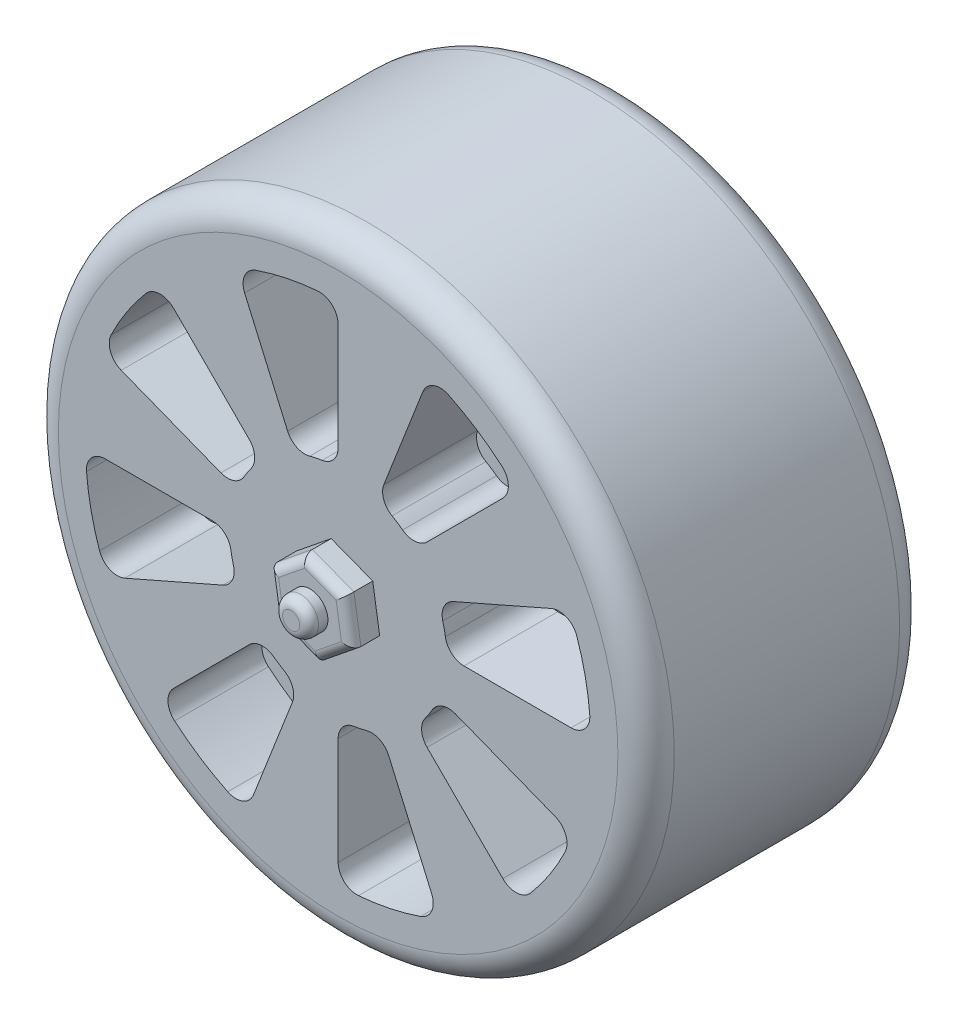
from build123d import *

# Parameters (mm, degrees)
ESQUISSE2_R                  = 32.795217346
BOSS_EXTRU_1_DEPTH           = 30
CONG_1_R                     = 3
ENL_V_MAT_EXTRU_1_DEPTH      = 10
R_P_TITION_CIRCULAIRE1_COUNT = 8
BOSS_EXTRU_2_DEPTH           = 3
ESQUISSE5_R                  = 1.911915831
BOSS_EXTRU_3_DEPTH           = 2
CONG_2_R                     = 1
CONG_3_R                     = 1
ECHELLE1_SCALE               = 20


with BuildPart() as part:
    # Esquisse2 → Boss.-Extru.1 (new body)
    with BuildSketch(Plane.XY):
        with Locations((116.843700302, 87.522105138)):
            Circle(ESQUISSE2_R)
    extrude(amount=BOSS_EXTRU_1_DEPTH)

    # Cong_1
    cong_1_edges = [part.edges().sort_by_distance(p)[0] for p in [
        (84.048482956, 87.522105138, 0),
        (84.048482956, 87.522105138, 30),
    ]]
    fillet(cong_1_edges, radius=CONG_1_R)

    # Esquisse3 → Enl_v. mat.-Extru.1 (cut)
    with BuildSketch(Plane.XY.offset(30)):
        with BuildLine():
            Line((111.46452224, 99.791466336), (106.884549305, 110.237921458))
            ThreePointArc((106.884549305, 110.237921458), (106.883953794, 111.842676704), (108.063003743, 112.931290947))
            ThreePointArc((108.063003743, 112.931290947), (111.329170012, 113.834028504), (114.682951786, 114.318719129))
            ThreePointArc((114.682951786, 114.318719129), (116.199890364, 113.795138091), (116.843700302, 112.325189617))
            Line((116.843700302, 112.325189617), (116.843700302, 100.918850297))
            ThreePointArc((116.843700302, 100.918850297), (116.358727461, 99.613211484), (115.139007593, 98.940772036))
            ThreePointArc((115.139007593, 98.940772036), (114.475473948, 98.821814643), (113.820014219, 98.664333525))
            ThreePointArc((113.820014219, 98.664333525), (112.432934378, 98.790432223), (111.46452224, 99.791466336))
        make_face()
    enl_v_mat_extru_1 = extrude(amount=-ENL_V_MAT_EXTRU_1_DEPTH, mode=Mode.SUBTRACT)

    # R_p_tition circulaire1: Enl_v. mat.-Extru.1 ×8 about axis
    r_p_tition_circulaire1_axis = Axis((116.843700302, 87.522105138, 0), (0, 0, 1))
    for i in range(1, R_P_TITION_CIRCULAIRE1_COUNT):
        add(enl_v_mat_extru_1.rotate(r_p_tition_circulaire1_axis, i * 360 / R_P_TITION_CIRCULAIRE1_COUNT), mode=Mode.SUBTRACT)

    # Esquisse4 → Boss.-Extru.2 (add)
    with BuildSketch(Plane.XY.offset(30)):
        Polygon((121.266094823, 85.824762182), (120.524839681, 90.50333966), (116.102445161, 92.200682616), (112.421305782, 89.219448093), (113.162560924, 84.540870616), (117.584955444, 82.84352766), align=None)
    extrude(amount=BOSS_EXTRU_2_DEPTH)

    # Esquisse5 → Boss.-Extru.3 (add)
    with BuildSketch(Plane.XY.offset(33)):
        with Locations((116.843700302, 87.522105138)):
            Circle(ESQUISSE5_R)
    extrude(amount=BOSS_EXTRU_3_DEPTH)

    # Cong_2
    cong_2_edges = [part.edges().sort_by_distance(p)[0] for p in [
        (114.931784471, 87.522105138, 35),
    ]]
    fillet(cong_2_edges, radius=CONG_2_R)

    # Cong_3
    cong_3_edges = [part.edges().sort_by_distance(p)[0] for p in [
        (119.425525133, 84.334144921, 33),
        (120.895467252, 88.164050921, 33),
        (118.313642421, 91.352011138, 33),
        (114.261875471, 90.710065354, 33),
        (112.791933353, 86.880159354, 33),
        (115.373758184, 83.692199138, 33),
    ]]
    fillet(cong_3_edges, radius=CONG_3_R)


with BuildPart() as part_1:
    # Echelle1: scaled about (116.843700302, 87.522105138, 13.996556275)
    add(part.part.scale(ECHELLE1_SCALE).moved(Location((-2220.030305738, -1662.919997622, -265.934569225))))


solid = part_1.part
